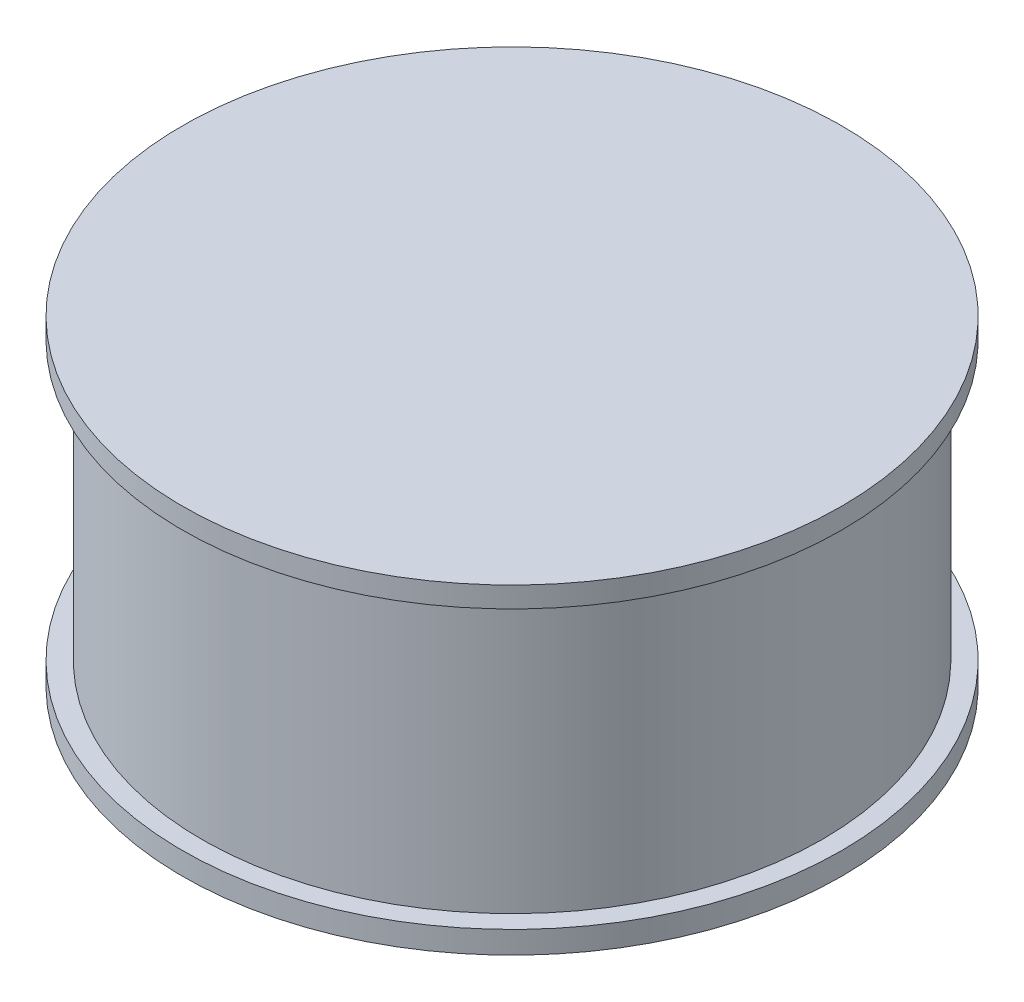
from build123d import *


with BuildPart() as part:
    # Esquisse1 → Base-R_volution (revolve)
    with BuildSketch(Plane.XY, mode=Mode.PRIVATE) as base_r_volution_sk:
        Polygon((-8, 58.019445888), (-34.699906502, 58.019445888), (-34.699906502, 60.368328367), (-32.664641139, 60.368328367), (-32.664641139, 89.588923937), (-34.699906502, 89.588923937), (-34.699906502, 91.769565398), (0, 91.769565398), (0, 85.918559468), (-8, 85.918559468), align=None)
    revolve(base_r_volution_sk.sketch.rotate(Axis((0, 59.069412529, 0), (0, 1, 0)), 180), axis=Axis((0, 59.069412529, 0), (0, 1, 0)))


solid = part.part
